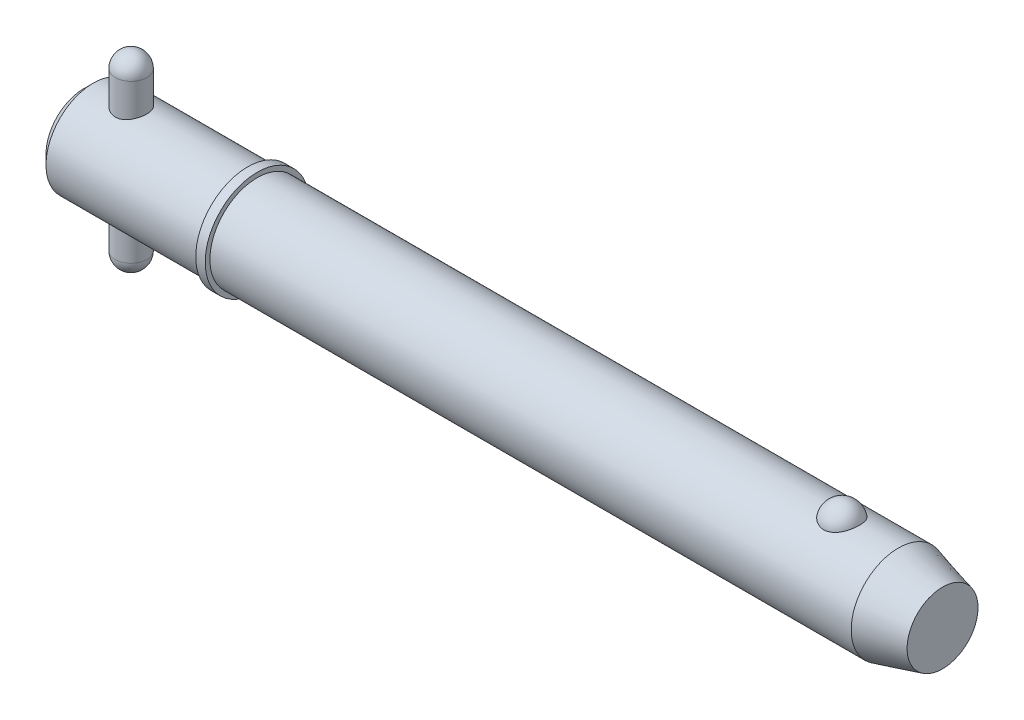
ISO-10303-21;
HEADER;
FILE_DESCRIPTION(('STEP AP214'),'2;1');
FILE_NAME('part.step','',(''),(''),'','','');
FILE_SCHEMA(('AUTOMOTIVE_DESIGN { 1 0 10303 214 1 1 1 1 }'));
ENDSEC;
DATA;
#1=APPLICATION_CONTEXT('core data for automotive mechanical design processes');
#2=APPLICATION_PROTOCOL_DEFINITION('international standard','automotive_design',2000,#1);
#3=PRODUCT_CONTEXT('',#1,'mechanical');
#4=PRODUCT('Part','Part','',(#3));
#5=PRODUCT_RELATED_PRODUCT_CATEGORY('part','',(#4));
#6=PRODUCT_DEFINITION_FORMATION('','',#4);
#7=PRODUCT_DEFINITION_CONTEXT('part definition',#1,'design');
#8=PRODUCT_DEFINITION('design','',#6,#7);
#9=PRODUCT_DEFINITION_SHAPE('','',#8);
#10=(LENGTH_UNIT() NAMED_UNIT(*) SI_UNIT(.MILLI.,.METRE.));
#11=(NAMED_UNIT(*) PLANE_ANGLE_UNIT() SI_UNIT($,.RADIAN.));
#12=(NAMED_UNIT(*) SI_UNIT($,.STERADIAN.) SOLID_ANGLE_UNIT());
#13=UNCERTAINTY_MEASURE_WITH_UNIT(LENGTH_MEASURE(1.E-05),#10,'distance_accuracy_value','');
#14=(GEOMETRIC_REPRESENTATION_CONTEXT(3) GLOBAL_UNCERTAINTY_ASSIGNED_CONTEXT((#13)) GLOBAL_UNIT_ASSIGNED_CONTEXT((#10,
#11,#12)) REPRESENTATION_CONTEXT('',''));
#15=CARTESIAN_POINT('',(0.,0.,0.));
#16=DIRECTION('',(0.,0.,1.));
#17=DIRECTION('',(1.,0.,0.));
#18=AXIS2_PLACEMENT_3D('',#15,#16,#17);
#19=CARTESIAN_POINT('',(9.525,19.05,0.));
#20=DIRECTION('',(0.,-1.,0.));
#21=DIRECTION('',(0.,0.,-1.));
#22=AXIS2_PLACEMENT_3D('',#19,#20,#21);
#23=CYLINDRICAL_SURFACE('',#22,3.175);
#24=CARTESIAN_POINT('',(9.525,-15.875,0.));
#25=DIRECTION('',(0.,-1.,0.));
#26=DIRECTION('',(0.,0.,-1.));
#27=AXIS2_PLACEMENT_3D('',#24,#25,#26);
#28=CIRCLE('',#27,3.175);
#29=CARTESIAN_POINT('',(9.525,-15.875,-3.175));
#30=VERTEX_POINT('',#29);
#31=EDGE_CURVE('P0_E10',#30,#30,#28,.F.);
#32=CARTESIAN_POINT('',(9.525,15.875,0.));
#33=DIRECTION('',(0.,-1.,0.));
#34=DIRECTION('',(0.,0.,-1.));
#35=AXIS2_PLACEMENT_3D('',#32,#33,#34);
#36=CIRCLE('',#35,3.175);
#37=CARTESIAN_POINT('',(9.525,15.875,-3.175));
#38=VERTEX_POINT('',#37);
#39=EDGE_CURVE('P0_E21',#38,#38,#36,.T.);
#40=CARTESIAN_POINT('',(9.525,-15.875,-3.175));
#41=CARTESIAN_POINT('',(9.525,-15.5442708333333,-3.175));
#42=CARTESIAN_POINT('',(9.525,-15.2135416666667,-3.175));
#43=CARTESIAN_POINT('',(9.525,-14.5520833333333,-3.175));
#44=CARTESIAN_POINT('',(9.525,-14.2213541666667,-3.175));
#45=CARTESIAN_POINT('',(9.525,-13.5598958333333,-3.175));
#46=CARTESIAN_POINT('',(9.525,-13.2291666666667,-3.175));
#47=CARTESIAN_POINT('',(9.525,-12.5677083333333,-3.175));
#48=CARTESIAN_POINT('',(9.525,-12.2369791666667,-3.175));
#49=CARTESIAN_POINT('',(9.525,-11.5755208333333,-3.175));
#50=CARTESIAN_POINT('',(9.525,-11.2447916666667,-3.175));
#51=CARTESIAN_POINT('',(9.525,-10.5833333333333,-3.175));
#52=CARTESIAN_POINT('',(9.525,-10.2526041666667,-3.175));
#53=CARTESIAN_POINT('',(9.525,-9.59114583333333,-3.175));
#54=CARTESIAN_POINT('',(9.525,-9.26041666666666,-3.175));
#55=CARTESIAN_POINT('',(9.525,-8.59895833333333,-3.175));
#56=CARTESIAN_POINT('',(9.525,-8.26822916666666,-3.175));
#57=CARTESIAN_POINT('',(9.525,-7.60677083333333,-3.175));
#58=CARTESIAN_POINT('',(9.525,-7.27604166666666,-3.175));
#59=CARTESIAN_POINT('',(9.525,-6.61458333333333,-3.175));
#60=CARTESIAN_POINT('',(9.525,-6.28385416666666,-3.175));
#61=CARTESIAN_POINT('',(9.525,-5.62239583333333,-3.175));
#62=CARTESIAN_POINT('',(9.525,-5.29166666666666,-3.175));
#63=CARTESIAN_POINT('',(9.525,-4.63020833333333,-3.175));
#64=CARTESIAN_POINT('',(9.525,-4.29947916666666,-3.175));
#65=CARTESIAN_POINT('',(9.525,-3.63802083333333,-3.175));
#66=CARTESIAN_POINT('',(9.525,-3.30729166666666,-3.175));
#67=CARTESIAN_POINT('',(9.525,-2.64583333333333,-3.175));
#68=CARTESIAN_POINT('',(9.525,-2.31510416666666,-3.175));
#69=CARTESIAN_POINT('',(9.525,-1.65364583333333,-3.175));
#70=CARTESIAN_POINT('',(9.525,-1.32291666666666,-3.175));
#71=CARTESIAN_POINT('',(9.525,-0.661458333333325,-3.175));
#72=CARTESIAN_POINT('',(9.525,-0.330729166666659,-3.175));
#73=CARTESIAN_POINT('',(9.525,0.330729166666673,-3.175));
#74=CARTESIAN_POINT('',(9.525,0.661458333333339,-3.175));
#75=CARTESIAN_POINT('',(9.525,1.32291666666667,-3.175));
#76=CARTESIAN_POINT('',(9.525,1.65364583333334,-3.175));
#77=CARTESIAN_POINT('',(9.525,2.31510416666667,-3.175));
#78=CARTESIAN_POINT('',(9.525,2.64583333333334,-3.175));
#79=CARTESIAN_POINT('',(9.525,3.30729166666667,-3.175));
#80=CARTESIAN_POINT('',(9.525,3.63802083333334,-3.175));
#81=CARTESIAN_POINT('',(9.525,4.29947916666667,-3.175));
#82=CARTESIAN_POINT('',(9.525,4.63020833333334,-3.175));
#83=CARTESIAN_POINT('',(9.525,5.29166666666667,-3.175));
#84=CARTESIAN_POINT('',(9.525,5.62239583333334,-3.175));
#85=CARTESIAN_POINT('',(9.525,6.28385416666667,-3.175));
#86=CARTESIAN_POINT('',(9.525,6.61458333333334,-3.175));
#87=CARTESIAN_POINT('',(9.525,7.27604166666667,-3.175));
#88=CARTESIAN_POINT('',(9.525,7.60677083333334,-3.175));
#89=CARTESIAN_POINT('',(9.525,8.26822916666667,-3.175));
#90=CARTESIAN_POINT('',(9.525,8.59895833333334,-3.175));
#91=CARTESIAN_POINT('',(9.525,9.26041666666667,-3.175));
#92=CARTESIAN_POINT('',(9.525,9.59114583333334,-3.175));
#93=CARTESIAN_POINT('',(9.525,10.2526041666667,-3.175));
#94=CARTESIAN_POINT('',(9.525,10.5833333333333,-3.175));
#95=CARTESIAN_POINT('',(9.525,11.2447916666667,-3.175));
#96=CARTESIAN_POINT('',(9.525,11.5755208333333,-3.175));
#97=CARTESIAN_POINT('',(9.525,12.2369791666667,-3.175));
#98=CARTESIAN_POINT('',(9.525,12.5677083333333,-3.175));
#99=CARTESIAN_POINT('',(9.525,13.2291666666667,-3.175));
#100=CARTESIAN_POINT('',(9.525,13.5598958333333,-3.175));
#101=CARTESIAN_POINT('',(9.525,14.2213541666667,-3.175));
#102=CARTESIAN_POINT('',(9.525,14.5520833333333,-3.175));
#103=CARTESIAN_POINT('',(9.525,15.2135416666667,-3.175));
#104=CARTESIAN_POINT('',(9.525,15.5442708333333,-3.175));
#105=CARTESIAN_POINT('',(9.525,15.875,-3.175));
#106=B_SPLINE_CURVE_WITH_KNOTS('',3,(#40,#41,#42,#43,#44,#45,#46,#47,#48,#49,#50,#51,#52,#53,
#54,#55,#56,#57,#58,#59,#60,#61,#62,#63,#64,#65,#66,#67,#68,#69,#70,#71,#72,#73,#74,#75,#76,#77,
#78,#79,#80,#81,#82,#83,#84,#85,#86,#87,#88,#89,#90,#91,#92,#93,#94,#95,#96,#97,#98,#99,#100,
#101,#102,#103,#104,#105),.UNSPECIFIED.,.F.,.F.,(4,2,2,2,2,2,2,2,2,2,2,2,2,2,2,2,2,2,2,2,2,2,2,
2,2,2,2,2,2,2,2,2,4),(0.,0.992187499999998,1.984375,2.9765625,3.96875,4.96093749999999,5.953125,
6.9453125,7.9375,8.92968749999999,9.921875,10.9140625,11.90625,12.8984375,13.890625,14.8828125,
15.875,16.8671875,17.859375,18.8515625,19.84375,20.8359375,21.828125,22.8203125,23.8125,
24.8046875,25.796875,26.7890625,27.78125,28.7734375,29.765625,30.7578125,31.75),.UNSPECIFIED.);
#107=EDGE_CURVE('P0_BSEAM14',#30,#38,#106,.T.);
#108=ORIENTED_EDGE('',*,*,#31,.T.);
#109=ORIENTED_EDGE('',*,*,#39,.T.);
#110=ORIENTED_EDGE('',*,*,#107,.T.);
#111=ORIENTED_EDGE('',*,*,#107,.F.);
#112=EDGE_LOOP('',(#108,#110,#109,#111));
#113=FACE_BOUND('',#112,.T.);
#114=ADVANCED_FACE('P0_F14',(#113),#23,.T.);
#115=CARTESIAN_POINT('',(9.525,-15.875,0.));
#116=DIRECTION('',(0.,0.,1.));
#117=DIRECTION('',(1.,0.,0.));
#118=AXIS2_PLACEMENT_3D('',#115,#116,#117);
#119=SPHERICAL_SURFACE('',#118,3.175);
#120=CARTESIAN_POINT('',(9.525,-15.875,0.));
#121=DIRECTION('',(0.,-1.,0.));
#122=DIRECTION('',(0.,0.,-1.));
#123=AXIS2_PLACEMENT_3D('',#120,#121,#122);
#124=SPHERICAL_SURFACE('',#123,3.175);
#125=ORIENTED_EDGE('',*,*,#31,.F.);
#126=EDGE_LOOP('',(#125));
#127=FACE_BOUND('',#126,.T.);
#128=ADVANCED_FACE('P0_F29',(#127),#124,.T.);
#129=CARTESIAN_POINT('',(9.525,15.875,0.));
#130=DIRECTION('',(0.,0.,1.));
#131=DIRECTION('',(1.,0.,0.));
#132=AXIS2_PLACEMENT_3D('',#129,#130,#131);
#133=SPHERICAL_SURFACE('',#132,3.175);
#134=CARTESIAN_POINT('',(9.525,15.875,0.));
#135=DIRECTION('',(0.,-1.,0.));
#136=DIRECTION('',(0.,0.,-1.));
#137=AXIS2_PLACEMENT_3D('',#134,#135,#136);
#138=SPHERICAL_SURFACE('',#137,3.175);
#139=ORIENTED_EDGE('',*,*,#39,.F.);
#140=EDGE_LOOP('',(#139));
#141=FACE_BOUND('',#140,.T.);
#142=ADVANCED_FACE('P0_F16',(#141),#138,.T.);
#143=CLOSED_SHELL('',(#114,#128,#142));
#144=MANIFOLD_SOLID_BREP('P0_B1',#143);
#145=CARTESIAN_POINT('',(0.,0.,0.));
#146=DIRECTION('',(1.,0.,0.));
#147=DIRECTION('',(0.,0.,-1.));
#148=AXIS2_PLACEMENT_3D('',#145,#146,#147);
#149=CYLINDRICAL_SURFACE('',#148,9.525);
#150=CARTESIAN_POINT('',(164.143054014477,0.,0.));
#151=DIRECTION('',(1.,0.,0.));
#152=DIRECTION('',(0.,0.,-1.));
#153=AXIS2_PLACEMENT_3D('',#150,#151,#152);
#154=CIRCLE('',#153,9.525);
#155=CARTESIAN_POINT('',(164.143054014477,0.,-9.525));
#156=VERTEX_POINT('',#155);
#157=EDGE_CURVE('P1_E81',#156,#156,#154,.T.);
#158=ORIENTED_EDGE('',*,*,#157,.F.);
#159=EDGE_LOOP('',(#158));
#160=FACE_BOUND('',#159,.T.);
#161=CARTESIAN_POINT('',(34.93,0.,0.));
#162=DIRECTION('',(1.,0.,0.));
#163=DIRECTION('',(0.,0.,-1.));
#164=AXIS2_PLACEMENT_3D('',#161,#162,#163);
#165=CIRCLE('',#164,9.525);
#166=CARTESIAN_POINT('',(34.93,0.,-9.525));
#167=VERTEX_POINT('',#166);
#168=EDGE_CURVE('P1_E85',#167,#167,#165,.T.);
#169=ORIENTED_EDGE('',*,*,#168,.T.);
#170=EDGE_LOOP('',(#169));
#171=FACE_BOUND('',#170,.T.);
#172=CARTESIAN_POINT('',(152.745757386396,8.80405803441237,3.63513233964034));
#173=CARTESIAN_POINT('',(152.651676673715,8.80405953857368,3.63513053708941));
#174=CARTESIAN_POINT('',(152.557561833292,8.80561325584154,3.63137461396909));
#175=CARTESIAN_POINT('',(152.370012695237,8.81177748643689,3.61638665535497));
#176=CARTESIAN_POINT('',(152.276578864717,8.81638992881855,3.60514990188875));
#177=CARTESIAN_POINT('',(151.997945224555,8.83467114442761,3.56024627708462));
#178=CARTESIAN_POINT('',(151.814691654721,8.85278327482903,3.51538626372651));
#179=CARTESIAN_POINT('',(151.459509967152,8.89871214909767,3.39742145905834));
#180=CARTESIAN_POINT('',(151.287553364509,8.92650327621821,3.32439116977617));
#181=CARTESIAN_POINT('',(150.958707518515,8.98874819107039,3.15220244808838));
#182=CARTESIAN_POINT('',(150.801811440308,9.02319893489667,3.05305594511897));
#183=CARTESIAN_POINT('',(150.502214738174,9.09629186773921,2.82797815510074));
#184=CARTESIAN_POINT('',(150.360060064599,9.13502685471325,2.70135138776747));
#185=CARTESIAN_POINT('',(150.098299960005,9.21186572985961,2.42641932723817));
#186=CARTESIAN_POINT('',(149.978701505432,9.24996941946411,2.2781073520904));
#187=CARTESIAN_POINT('',(149.759645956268,9.32341082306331,1.95652290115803));
#188=CARTESIAN_POINT('',(149.661317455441,9.35855090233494,1.78243511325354));
#189=CARTESIAN_POINT('',(149.493819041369,9.42045142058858,1.41937246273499));
#190=CARTESIAN_POINT('',(149.424651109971,9.44721128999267,1.23039658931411));
#191=CARTESIAN_POINT('',(149.316199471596,9.48990641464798,0.840370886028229));
#192=CARTESIAN_POINT('',(149.277288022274,9.50570658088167,0.639202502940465));
#193=CARTESIAN_POINT('',(149.231555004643,9.52433146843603,0.232664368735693));
#194=CARTESIAN_POINT('',(149.224732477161,9.52715657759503,0.0272947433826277));
#195=CARTESIAN_POINT('',(149.243255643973,9.51956918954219,-0.380478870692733));
#196=CARTESIAN_POINT('',(149.268405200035,9.50923740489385,-0.582893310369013));
#197=CARTESIAN_POINT('',(149.35002537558,9.47651897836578,-0.98029399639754));
#198=CARTESIAN_POINT('',(149.406496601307,9.45413210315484,-1.17528009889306));
#199=CARTESIAN_POINT('',(149.549719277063,9.39954044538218,-1.55263697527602));
#200=CARTESIAN_POINT('',(149.636512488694,9.36732213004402,-1.73498993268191));
#201=CARTESIAN_POINT('',(149.838610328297,9.29640700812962,-2.08177763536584));
#202=CARTESIAN_POINT('',(149.953917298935,9.25770966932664,-2.24621090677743));
#203=CARTESIAN_POINT('',(150.211264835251,9.17775604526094,-2.5533833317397));
#204=CARTESIAN_POINT('',(150.353434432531,9.136488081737,-2.696011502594));
#205=CARTESIAN_POINT('',(150.66089985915,9.05620497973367,-2.95451229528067));
#206=CARTESIAN_POINT('',(150.826193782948,9.01718965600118,-3.07038711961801));
#207=CARTESIAN_POINT('',(151.172052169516,8.94680019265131,-3.26976836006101));
#208=CARTESIAN_POINT('',(151.352227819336,8.91528408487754,-3.35389750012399));
#209=CARTESIAN_POINT('',(151.725651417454,8.86272514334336,-3.49043503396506));
#210=CARTESIAN_POINT('',(151.918894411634,8.84167836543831,-3.54285537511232));
#211=CARTESIAN_POINT('',(152.302503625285,8.81348056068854,-3.61241306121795));
#212=CARTESIAN_POINT('',(152.492525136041,8.80568348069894,-3.6311933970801));
#213=CARTESIAN_POINT('',(152.873190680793,8.80289410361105,-3.63795342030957));
#214=CARTESIAN_POINT('',(153.063834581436,8.80789922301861,-3.62593932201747));
#215=CARTESIAN_POINT('',(153.434007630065,8.82974915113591,-3.57238430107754));
#216=CARTESIAN_POINT('',(153.613697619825,8.84621463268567,-3.53178890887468));
#217=CARTESIAN_POINT('',(153.963422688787,8.88875330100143,-3.42331083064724));
#218=CARTESIAN_POINT('',(154.133456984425,8.91482726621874,-3.35542593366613));
#219=CARTESIAN_POINT('',(154.463237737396,8.97448239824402,-3.19248225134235));
#220=CARTESIAN_POINT('',(154.622680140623,9.00821446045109,-3.0968647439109));
#221=CARTESIAN_POINT('',(154.923513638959,9.07935398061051,-2.88162736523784));
#222=CARTESIAN_POINT('',(155.064900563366,9.11676228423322,-2.76200196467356));
#223=CARTESIAN_POINT('',(155.33331931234,9.19347419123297,-2.49516285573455));
#224=CARTESIAN_POINT('',(155.459275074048,9.23277872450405,-2.34686614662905));
#225=CARTESIAN_POINT('',(155.685522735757,9.3073761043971,-2.03093683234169));
#226=CARTESIAN_POINT('',(155.78581004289,9.34266823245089,-1.86330077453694));
#227=CARTESIAN_POINT('',(155.961514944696,9.40674710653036,-1.50744893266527));
#228=CARTESIAN_POINT('',(156.036041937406,9.43529176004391,-1.31874876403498));
#229=CARTESIAN_POINT('',(156.15416505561,9.48144132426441,-0.930631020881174));
#230=CARTESIAN_POINT('',(156.197760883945,9.49904612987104,-0.731213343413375));
#231=CARTESIAN_POINT('',(156.253158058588,9.5215314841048,-0.327147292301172));
#232=CARTESIAN_POINT('',(156.264935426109,9.52640243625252,-0.122495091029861));
#233=CARTESIAN_POINT('',(156.256382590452,9.5228957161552,0.28601848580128));
#234=CARTESIAN_POINT('',(156.23605305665,9.5145183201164,0.489879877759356));
#235=CARTESIAN_POINT('',(156.163884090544,9.48544083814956,0.88999431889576));
#236=CARTESIAN_POINT('',(156.112199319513,9.46480124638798,1.08627971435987));
#237=CARTESIAN_POINT('',(155.978491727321,9.4133389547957,1.46682086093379));
#238=CARTESIAN_POINT('',(155.896466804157,9.38251554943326,1.65107577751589));
#239=CARTESIAN_POINT('',(155.70319292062,9.31365636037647,2.00346348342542));
#240=CARTESIAN_POINT('',(155.591783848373,9.27558138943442,2.17150083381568));
#241=CARTESIAN_POINT('',(155.342294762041,9.19638714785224,2.48563115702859));
#242=CARTESIAN_POINT('',(155.204216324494,9.15526805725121,2.63172542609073));
#243=CARTESIAN_POINT('',(154.904843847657,9.07465393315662,2.89750997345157));
#244=CARTESIAN_POINT('',(154.743610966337,9.03515496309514,3.01726776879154));
#245=CARTESIAN_POINT('',(154.401613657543,8.96227564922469,3.22732920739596));
#246=CARTESIAN_POINT('',(154.220841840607,8.92889763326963,3.31762165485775));
#247=CARTESIAN_POINT('',(153.851445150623,8.8734538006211,3.46314419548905));
#248=CARTESIAN_POINT('',(153.66332371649,8.85102983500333,3.51950082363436));
#249=CARTESIAN_POINT('',(153.37578699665,8.82666967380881,3.57993683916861));
#250=CARTESIAN_POINT('',(153.279133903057,8.82009725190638,3.59606217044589));
#251=CARTESIAN_POINT('',(153.084677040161,8.81020897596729,3.62022512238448));
#252=CARTESIAN_POINT('',(152.986874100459,8.80689090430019,3.62826825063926));
#253=CARTESIAN_POINT('',(152.841224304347,8.80445615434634,3.63416760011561));
#254=CARTESIAN_POINT('',(152.793495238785,8.80405727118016,3.63513325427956));
#255=CARTESIAN_POINT('',(152.745757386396,8.80405803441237,3.63513233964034));
#256=B_SPLINE_CURVE_WITH_KNOTS('',3,(#172,#173,#174,#175,#176,#177,#178,#179,#180,#181,#182,
#183,#184,#185,#186,#187,#188,#189,#190,#191,#192,#193,#194,#195,#196,#197,#198,#199,#200,#201,
#202,#203,#204,#205,#206,#207,#208,#209,#210,#211,#212,#213,#214,#215,#216,#217,#218,#219,#220,
#221,#222,#223,#224,#225,#226,#227,#228,#229,#230,#231,#232,#233,#234,#235,#236,#237,#238,#239,
#240,#241,#242,#243,#244,#245,#246,#247,#248,#249,#250,#251,#252,#253,#254,#255),.UNSPECIFIED.,
.T.,.F.,(4,2,2,2,2,2,2,2,2,2,2,2,2,2,2,2,2,2,2,2,2,2,2,2,2,2,2,2,2,2,2,2,2,2,2,2,2,2,2,2,2,4),
(0.,0.282202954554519,0.564584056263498,1.13017050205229,1.69427128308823,2.25811483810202,
2.83836627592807,3.41879688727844,4.02497117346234,4.63118665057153,5.24474754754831,
5.85829010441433,6.46808687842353,7.07789545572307,7.68854723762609,8.299249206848,
8.91296283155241,9.52662591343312,10.1275338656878,10.7282152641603,11.2986646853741,
11.8689989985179,12.4213015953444,12.973648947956,13.5380053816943,14.1024919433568,
14.695298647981,15.2882113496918,15.8999469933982,16.5116885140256,17.1238909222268,
17.7360805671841,18.3452748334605,18.9545113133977,19.567138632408,20.179729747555,
20.7907316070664,21.4019653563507,21.9915938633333,22.2859053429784,22.5800161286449,
22.7232098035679),.UNSPECIFIED.);
#257=CARTESIAN_POINT('',(152.745757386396,8.80405803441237,3.63513233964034));
#258=VERTEX_POINT('',#257);
#259=EDGE_CURVE('P1_E35',#258,#258,#256,.T.);
#260=ORIENTED_EDGE('',*,*,#259,.T.);
#261=EDGE_LOOP('',(#260));
#262=FACE_BOUND('',#261,.T.);
#263=ADVANCED_FACE('P1_F13',(#160,#171,#262),#149,.T.);
#264=CARTESIAN_POINT('',(0.,0.,0.));
#265=DIRECTION('',(-1.,0.,0.));
#266=DIRECTION('',(0.,0.,1.));
#267=AXIS2_PLACEMENT_3D('',#264,#265,#266);
#268=PLANE('',#267);
#269=CARTESIAN_POINT('',(0.,0.,0.));
#270=DIRECTION('',(1.,0.,0.));
#271=DIRECTION('',(0.,0.,-1.));
#272=AXIS2_PLACEMENT_3D('',#269,#270,#271);
#273=CIRCLE('',#272,7.62);
#274=CARTESIAN_POINT('',(0.,0.,-7.62));
#275=VERTEX_POINT('',#274);
#276=EDGE_CURVE('P1_E9',#275,#275,#273,.T.);
#277=ORIENTED_EDGE('',*,*,#276,.F.);
#278=EDGE_LOOP('',(#277));
#279=FACE_BOUND('',#278,.T.);
#280=ADVANCED_FACE('P1_F15',(#279),#268,.T.);
#281=CARTESIAN_POINT('',(1.90499999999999,0.,0.));
#282=DIRECTION('',(1.,0.,0.));
#283=DIRECTION('',(0.,0.,-1.));
#284=AXIS2_PLACEMENT_3D('',#281,#282,#283);
#285=CONICAL_SURFACE('',#284,9.525,0.785398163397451);
#286=ORIENTED_EDGE('',*,*,#276,.T.);
#287=EDGE_LOOP('',(#286));
#288=FACE_BOUND('',#287,.T.);
#289=CARTESIAN_POINT('',(1.90499999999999,0.,0.));
#290=DIRECTION('',(1.,0.,0.));
#291=DIRECTION('',(0.,0.,-1.));
#292=AXIS2_PLACEMENT_3D('',#289,#290,#291);
#293=CIRCLE('',#292,9.525);
#294=CARTESIAN_POINT('',(1.90499999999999,0.,-9.525));
#295=VERTEX_POINT('',#294);
#296=EDGE_CURVE('P1_E26',#295,#295,#293,.T.);
#297=ORIENTED_EDGE('',*,*,#296,.F.);
#298=EDGE_LOOP('',(#297));
#299=FACE_BOUND('',#298,.T.);
#300=ADVANCED_FACE('P1_F77',(#288,#299),#285,.T.);
#301=CARTESIAN_POINT('',(0.,0.,0.));
#302=DIRECTION('',(1.,0.,0.));
#303=DIRECTION('',(0.,0.,-1.));
#304=AXIS2_PLACEMENT_3D('',#301,#302,#303);
#305=CYLINDRICAL_SURFACE('',#304,9.525);
#306=CARTESIAN_POINT('',(9.525,-8.98025612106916,3.175));
#307=CARTESIAN_POINT('',(9.35206354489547,-8.98025555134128,3.17500081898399));
#308=CARTESIAN_POINT('',(9.17913201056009,-8.98530617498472,3.16082293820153));
#309=CARTESIAN_POINT('',(8.83839221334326,-9.00485797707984,3.10467734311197));
#310=CARTESIAN_POINT('',(8.67058479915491,-9.0193607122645,3.06270505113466));
#311=CARTESIAN_POINT('',(8.34508461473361,-9.05599546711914,2.95260866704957));
#312=CARTESIAN_POINT('',(8.18737272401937,-9.07811252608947,2.88453582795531));
#313=CARTESIAN_POINT('',(7.88555684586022,-9.12746212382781,2.72434567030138));
#314=CARTESIAN_POINT('',(7.74145587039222,-9.1546957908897,2.63222304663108));
#315=CARTESIAN_POINT('',(7.46531411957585,-9.21240503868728,2.42268738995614));
#316=CARTESIAN_POINT('',(7.33388351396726,-9.24296141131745,2.30449228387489));
#317=CARTESIAN_POINT('',(7.09229340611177,-9.30319020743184,2.0478358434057));
#318=CARTESIAN_POINT('',(6.98213731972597,-9.33286248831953,1.90937126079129));
#319=CARTESIAN_POINT('',(6.78345450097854,-9.38891527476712,1.61164431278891));
#320=CARTESIAN_POINT('',(6.69556709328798,-9.41518969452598,1.45193356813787));
#321=CARTESIAN_POINT('',(6.54814671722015,-9.46053437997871,1.11896913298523));
#322=CARTESIAN_POINT('',(6.48860610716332,-9.47960658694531,0.945719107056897));
#323=CARTESIAN_POINT('',(6.40163866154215,-9.50782564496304,0.596991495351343));
#324=CARTESIAN_POINT('',(6.373166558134,-9.5172947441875,0.421801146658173));
#325=CARTESIAN_POINT('',(6.3458207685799,-9.52638456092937,0.068890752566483));
#326=CARTESIAN_POINT('',(6.34693945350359,-9.52600781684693,-0.108828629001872));
#327=CARTESIAN_POINT('',(6.37808050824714,-9.51566675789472,-0.454353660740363));
#328=CARTESIAN_POINT('',(6.4069675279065,-9.50607905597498,-0.622274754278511));
#329=CARTESIAN_POINT('',(6.490947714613,-9.47886621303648,-0.950732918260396));
#330=CARTESIAN_POINT('',(6.54604265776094,-9.46124052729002,-1.11126948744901));
#331=CARTESIAN_POINT('',(6.68153768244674,-9.41945253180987,-1.42288410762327));
#332=CARTESIAN_POINT('',(6.76226085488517,-9.3952073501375,-1.57381010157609));
#333=CARTESIAN_POINT('',(6.94645456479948,-9.34270397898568,-1.86030973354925));
#334=CARTESIAN_POINT('',(7.04993142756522,-9.31444467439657,-1.99587908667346));
#335=CARTESIAN_POINT('',(7.28241619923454,-9.25532159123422,-2.2545702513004));
#336=CARTESIAN_POINT('',(7.4123967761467,-9.22439783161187,-2.37680549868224));
#337=CARTESIAN_POINT('',(7.69127470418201,-9.1645528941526,-2.5980302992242));
#338=CARTESIAN_POINT('',(7.84017496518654,-9.13563202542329,-2.6970162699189));
#339=CARTESIAN_POINT('',(8.15547526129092,-9.08273917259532,-2.87016016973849));
#340=CARTESIAN_POINT('',(8.32209451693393,-9.05884361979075,-2.94394402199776));
#341=CARTESIAN_POINT('',(8.66638917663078,-9.01959241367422,-3.06210713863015));
#342=CARTESIAN_POINT('',(8.84405991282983,-9.00423318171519,-3.10649872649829));
#343=CARTESIAN_POINT('',(9.19682677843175,-8.98460345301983,-3.16281207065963));
#344=CARTESIAN_POINT('',(9.37167742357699,-8.9798639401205,-3.17610837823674));
#345=CARTESIAN_POINT('',(9.72113927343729,-8.9806993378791,-3.17374726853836));
#346=CARTESIAN_POINT('',(9.89575051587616,-8.98627237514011,-3.15809511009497));
#347=CARTESIAN_POINT('',(10.2335233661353,-9.00663737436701,-3.09951644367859));
#348=CARTESIAN_POINT('',(10.3968722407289,-9.02110608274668,-3.05754530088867));
#349=CARTESIAN_POINT('',(10.7141759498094,-9.05727657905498,-2.94866651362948));
#350=CARTESIAN_POINT('',(10.8681291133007,-9.07897964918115,-2.88175444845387));
#351=CARTESIAN_POINT('',(11.1676828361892,-9.12802586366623,-2.72248103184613));
#352=CARTESIAN_POINT('',(11.3128635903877,-9.1555260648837,-2.62937980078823));
#353=CARTESIAN_POINT('',(11.5860387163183,-9.21276315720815,-2.42120937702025));
#354=CARTESIAN_POINT('',(11.7140280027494,-9.24250070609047,-2.30613370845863));
#355=CARTESIAN_POINT('',(11.9555513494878,-9.30259247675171,-2.05070616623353));
#356=CARTESIAN_POINT('',(12.0680936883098,-9.33290753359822,-1.90940458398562));
#357=CARTESIAN_POINT('',(12.267933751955,-9.3893275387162,-1.60917665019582));
#358=CARTESIAN_POINT('',(12.3552323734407,-9.41543263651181,-1.45025092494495));
#359=CARTESIAN_POINT('',(12.5013088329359,-9.46036988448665,-1.12007606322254));
#360=CARTESIAN_POINT('',(12.5602723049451,-9.47924920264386,-0.9489158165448));
#361=CARTESIAN_POINT('',(12.6483355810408,-9.50781089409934,-0.598355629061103));
#362=CARTESIAN_POINT('',(12.6774461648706,-9.5174965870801,-0.4189586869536));
#363=CARTESIAN_POINT('',(12.7040070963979,-9.52632915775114,-0.066088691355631));
#364=CARTESIAN_POINT('',(12.7028811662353,-9.52594996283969,0.107266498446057));
#365=CARTESIAN_POINT('',(12.6725130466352,-9.51586223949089,0.451202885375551));
#366=CARTESIAN_POINT('',(12.643273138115,-9.50615446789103,0.621784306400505));
#367=CARTESIAN_POINT('',(12.5584514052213,-9.47867404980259,0.952633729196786));
#368=CARTESIAN_POINT('',(12.5032953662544,-9.46103195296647,1.1130225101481));
#369=CARTESIAN_POINT('',(12.3686013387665,-9.41949985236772,1.42233126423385));
#370=CARTESIAN_POINT('',(12.2890589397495,-9.39560871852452,1.57124915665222));
#371=CARTESIAN_POINT('',(12.1044667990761,-9.34294133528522,1.85938800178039));
#372=CARTESIAN_POINT('',(11.9985831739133,-9.31401720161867,1.9980473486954));
#373=CARTESIAN_POINT('',(11.7657327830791,-9.25490239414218,2.25609475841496));
#374=CARTESIAN_POINT('',(11.6387592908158,-9.22471131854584,2.37547664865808));
#375=CARTESIAN_POINT('',(11.3613902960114,-9.16505913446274,2.59633024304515));
#376=CARTESIAN_POINT('',(11.2102725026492,-9.13567286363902,2.69691791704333));
#377=CARTESIAN_POINT('',(10.8923631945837,-9.08241113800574,2.87119803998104));
#378=CARTESIAN_POINT('',(10.7255757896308,-9.05853424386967,2.94489751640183));
#379=CARTESIAN_POINT('',(10.3887212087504,-9.02021736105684,3.06020415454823));
#380=CARTESIAN_POINT('',(10.219143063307,-9.00539959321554,3.10311136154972));
#381=CARTESIAN_POINT('',(9.87470703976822,-8.98542092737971,3.16050396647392));
#382=CARTESIAN_POINT('',(9.699851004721,-8.98025669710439,3.17499917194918));
#383=CARTESIAN_POINT('',(9.525,-8.98025612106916,3.175));
#384=B_SPLINE_CURVE_WITH_KNOTS('',3,(#306,#307,#308,#309,#310,#311,#312,#313,#314,#315,#316,
#317,#318,#319,#320,#321,#322,#323,#324,#325,#326,#327,#328,#329,#330,#331,#332,#333,#334,#335,
#336,#337,#338,#339,#340,#341,#342,#343,#344,#345,#346,#347,#348,#349,#350,#351,#352,#353,#354,
#355,#356,#357,#358,#359,#360,#361,#362,#363,#364,#365,#366,#367,#368,#369,#370,#371,#372,#373,
#374,#375,#376,#377,#378,#379,#380,#381,#382,#383),.UNSPECIFIED.,.T.,.F.,(4,2,2,2,2,2,2,2,2,2,2,
2,2,2,2,2,2,2,2,2,2,2,2,2,2,2,2,2,2,2,2,2,2,2,2,2,2,2,4),(0.,0.518161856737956,1.03640907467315,
1.55364379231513,2.07099270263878,2.60671746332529,3.14252816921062,3.69231882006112,
4.24196117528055,4.77247962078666,5.30286129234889,5.81244090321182,6.32205505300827,
6.83836754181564,7.3548237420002,7.89559553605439,8.43645060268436,8.98501631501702,
9.53335188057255,10.056948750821,10.5804505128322,11.0859695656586,11.5915782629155,
12.1132237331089,12.6350231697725,13.1819271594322,13.7288117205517,14.2720628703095,
14.815117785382,15.3326491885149,15.8501386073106,16.3594083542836,16.868770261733,
17.3969527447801,17.925304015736,18.4743376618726,19.023227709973,19.5473069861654,
20.0712053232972),.UNSPECIFIED.);
#385=CARTESIAN_POINT('',(9.525,-8.98025612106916,3.175));
#386=VERTEX_POINT('',#385);
#387=EDGE_CURVE('P1_E17',#386,#386,#384,.T.);
#388=ORIENTED_EDGE('',*,*,#387,.F.);
#389=EDGE_LOOP('',(#388));
#390=FACE_BOUND('',#389,.T.);
#391=CARTESIAN_POINT('',(9.525,8.98025612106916,3.175));
#392=CARTESIAN_POINT('',(9.69793645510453,8.98025555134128,3.17500081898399));
#393=CARTESIAN_POINT('',(9.87086798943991,8.98530617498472,3.16082293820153));
#394=CARTESIAN_POINT('',(10.2116077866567,9.00485797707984,3.10467734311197));
#395=CARTESIAN_POINT('',(10.3794152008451,9.0193607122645,3.06270505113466));
#396=CARTESIAN_POINT('',(10.7049153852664,9.05599546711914,2.95260866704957));
#397=CARTESIAN_POINT('',(10.8626272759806,9.07811252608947,2.88453582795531));
#398=CARTESIAN_POINT('',(11.1644431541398,9.12746212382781,2.72434567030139));
#399=CARTESIAN_POINT('',(11.3085441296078,9.15469579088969,2.63222304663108));
#400=CARTESIAN_POINT('',(11.5846858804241,9.21240503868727,2.42268738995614));
#401=CARTESIAN_POINT('',(11.7161164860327,9.24296141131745,2.30449228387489));
#402=CARTESIAN_POINT('',(11.9577065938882,9.30319020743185,2.0478358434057));
#403=CARTESIAN_POINT('',(12.067862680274,9.33286248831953,1.90937126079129));
#404=CARTESIAN_POINT('',(12.2665454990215,9.38891527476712,1.61164431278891));
#405=CARTESIAN_POINT('',(12.354432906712,9.41518969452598,1.45193356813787));
#406=CARTESIAN_POINT('',(12.5018532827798,9.46053437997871,1.11896913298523));
#407=CARTESIAN_POINT('',(12.5613938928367,9.47960658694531,0.945719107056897));
#408=CARTESIAN_POINT('',(12.6483613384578,9.50782564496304,0.596991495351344));
#409=CARTESIAN_POINT('',(12.676833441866,9.5172947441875,0.421801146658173));
#410=CARTESIAN_POINT('',(12.7041792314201,9.52638456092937,0.0688907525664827));
#411=CARTESIAN_POINT('',(12.7030605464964,9.52600781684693,-0.108828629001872));
#412=CARTESIAN_POINT('',(12.6719194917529,9.51566675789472,-0.454353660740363));
#413=CARTESIAN_POINT('',(12.6430324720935,9.50607905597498,-0.622274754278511));
#414=CARTESIAN_POINT('',(12.559052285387,9.47886621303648,-0.950732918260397));
#415=CARTESIAN_POINT('',(12.5039573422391,9.46124052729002,-1.11126948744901));
#416=CARTESIAN_POINT('',(12.3684623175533,9.41945253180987,-1.42288410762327));
#417=CARTESIAN_POINT('',(12.2877391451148,9.3952073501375,-1.57381010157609));
#418=CARTESIAN_POINT('',(12.1035454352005,9.34270397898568,-1.86030973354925));
#419=CARTESIAN_POINT('',(12.0000685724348,9.31444467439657,-1.99587908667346));
#420=CARTESIAN_POINT('',(11.7675838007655,9.25532159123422,-2.2545702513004));
#421=CARTESIAN_POINT('',(11.6376032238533,9.22439783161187,-2.37680549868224));
#422=CARTESIAN_POINT('',(11.358725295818,9.1645528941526,-2.5980302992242));
#423=CARTESIAN_POINT('',(11.2098250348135,9.13563202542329,-2.6970162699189));
#424=CARTESIAN_POINT('',(10.8945247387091,9.08273917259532,-2.87016016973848));
#425=CARTESIAN_POINT('',(10.7279054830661,9.05884361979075,-2.94394402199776));
#426=CARTESIAN_POINT('',(10.3836108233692,9.01959241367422,-3.06210713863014));
#427=CARTESIAN_POINT('',(10.2059400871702,9.00423318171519,-3.10649872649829));
#428=CARTESIAN_POINT('',(9.85317322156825,8.98460345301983,-3.16281207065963));
#429=CARTESIAN_POINT('',(9.67832257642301,8.9798639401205,-3.17610837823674));
#430=CARTESIAN_POINT('',(9.32886072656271,8.9806993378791,-3.17374726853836));
#431=CARTESIAN_POINT('',(9.15424948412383,8.98627237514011,-3.15809511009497));
#432=CARTESIAN_POINT('',(8.81647663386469,9.00663737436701,-3.09951644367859));
#433=CARTESIAN_POINT('',(8.65312775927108,9.02110608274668,-3.05754530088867));
#434=CARTESIAN_POINT('',(8.33582405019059,9.05727657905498,-2.94866651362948));
#435=CARTESIAN_POINT('',(8.18187088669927,9.07897964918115,-2.88175444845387));
#436=CARTESIAN_POINT('',(7.88231716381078,9.12802586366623,-2.72248103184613));
#437=CARTESIAN_POINT('',(7.73713640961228,9.1555260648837,-2.62937980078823));
#438=CARTESIAN_POINT('',(7.46396128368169,9.21276315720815,-2.42120937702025));
#439=CARTESIAN_POINT('',(7.33597199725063,9.24250070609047,-2.30613370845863));
#440=CARTESIAN_POINT('',(7.09444865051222,9.30259247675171,-2.05070616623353));
#441=CARTESIAN_POINT('',(6.98190631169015,9.33290753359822,-1.90940458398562));
#442=CARTESIAN_POINT('',(6.78206624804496,9.3893275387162,-1.60917665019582));
#443=CARTESIAN_POINT('',(6.6947676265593,9.41543263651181,-1.45025092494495));
#444=CARTESIAN_POINT('',(6.54869116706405,9.46036988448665,-1.12007606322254));
#445=CARTESIAN_POINT('',(6.48972769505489,9.47924920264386,-0.948915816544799));
#446=CARTESIAN_POINT('',(6.40166441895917,9.50781089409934,-0.598355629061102));
#447=CARTESIAN_POINT('',(6.3725538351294,9.5174965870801,-0.418958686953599));
#448=CARTESIAN_POINT('',(6.34599290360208,9.52632915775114,-0.0660886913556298));
#449=CARTESIAN_POINT('',(6.3471188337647,9.52594996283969,0.107266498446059));
#450=CARTESIAN_POINT('',(6.37748695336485,9.51586223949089,0.451202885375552));
#451=CARTESIAN_POINT('',(6.40672686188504,9.50615446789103,0.621784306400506));
#452=CARTESIAN_POINT('',(6.49154859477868,9.47867404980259,0.952633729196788));
#453=CARTESIAN_POINT('',(6.54670463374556,9.46103195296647,1.11302251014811));
#454=CARTESIAN_POINT('',(6.68139866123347,9.41949985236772,1.42233126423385));
#455=CARTESIAN_POINT('',(6.76094106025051,9.39560871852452,1.57124915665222));
#456=CARTESIAN_POINT('',(6.94553320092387,9.34294133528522,1.85938800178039));
#457=CARTESIAN_POINT('',(7.05141682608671,9.31401720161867,1.9980473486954));
#458=CARTESIAN_POINT('',(7.28426721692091,9.25490239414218,2.25609475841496));
#459=CARTESIAN_POINT('',(7.41124070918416,9.22471131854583,2.37547664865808));
#460=CARTESIAN_POINT('',(7.68860970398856,9.16505913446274,2.59633024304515));
#461=CARTESIAN_POINT('',(7.83972749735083,9.13567286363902,2.69691791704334));
#462=CARTESIAN_POINT('',(8.15763680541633,9.08241113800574,2.87119803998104));
#463=CARTESIAN_POINT('',(8.32442421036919,9.05853424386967,2.94489751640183));
#464=CARTESIAN_POINT('',(8.66127879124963,9.02021736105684,3.06020415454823));
#465=CARTESIAN_POINT('',(8.83085693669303,9.00539959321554,3.10311136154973));
#466=CARTESIAN_POINT('',(9.17529296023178,8.98542092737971,3.16050396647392));
#467=CARTESIAN_POINT('',(9.350148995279,8.98025669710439,3.17499917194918));
#468=CARTESIAN_POINT('',(9.525,8.98025612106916,3.175));
#469=B_SPLINE_CURVE_WITH_KNOTS('',3,(#391,#392,#393,#394,#395,#396,#397,#398,#399,#400,#401,
#402,#403,#404,#405,#406,#407,#408,#409,#410,#411,#412,#413,#414,#415,#416,#417,#418,#419,#420,
#421,#422,#423,#424,#425,#426,#427,#428,#429,#430,#431,#432,#433,#434,#435,#436,#437,#438,#439,
#440,#441,#442,#443,#444,#445,#446,#447,#448,#449,#450,#451,#452,#453,#454,#455,#456,#457,#458,
#459,#460,#461,#462,#463,#464,#465,#466,#467,#468),.UNSPECIFIED.,.T.,.F.,(4,2,2,2,2,2,2,2,2,2,2,
2,2,2,2,2,2,2,2,2,2,2,2,2,2,2,2,2,2,2,2,2,2,2,2,2,2,2,4),(0.,0.518161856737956,1.03640907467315,
1.55364379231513,2.07099270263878,2.60671746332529,3.14252816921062,3.69231882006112,
4.24196117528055,4.77247962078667,5.30286129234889,5.81244090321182,6.32205505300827,
6.83836754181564,7.3548237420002,7.89559553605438,8.43645060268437,8.98501631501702,
9.53335188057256,10.056948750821,10.5804505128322,11.0859695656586,11.5915782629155,
12.1132237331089,12.6350231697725,13.1819271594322,13.7288117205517,14.2720628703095,
14.815117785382,15.3326491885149,15.8501386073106,16.3594083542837,16.868770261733,
17.3969527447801,17.9253040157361,18.4743376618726,19.023227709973,19.5473069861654,
20.0712053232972),.UNSPECIFIED.);
#470=CARTESIAN_POINT('',(9.525,8.98025612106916,3.175));
#471=VERTEX_POINT('',#470);
#472=EDGE_CURVE('P1_E43',#471,#471,#469,.T.);
#473=ORIENTED_EDGE('',*,*,#472,.F.);
#474=EDGE_LOOP('',(#473));
#475=FACE_BOUND('',#474,.T.);
#476=ORIENTED_EDGE('',*,*,#296,.T.);
#477=EDGE_LOOP('',(#476));
#478=FACE_BOUND('',#477,.T.);
#479=CARTESIAN_POINT('',(33.025,0.,0.));
#480=DIRECTION('',(1.,0.,0.));
#481=DIRECTION('',(0.,0.,-1.));
#482=AXIS2_PLACEMENT_3D('',#479,#480,#481);
#483=CIRCLE('',#482,9.525);
#484=CARTESIAN_POINT('',(33.025,0.,-9.525));
#485=VERTEX_POINT('',#484);
#486=EDGE_CURVE('P1_E31',#485,#485,#483,.T.);
#487=ORIENTED_EDGE('',*,*,#486,.F.);
#488=EDGE_LOOP('',(#487));
#489=FACE_BOUND('',#488,.T.);
#490=ADVANCED_FACE('P1_F103',(#390,#475,#478,#489),#305,.T.);
#491=CARTESIAN_POINT('',(33.025,9.525,0.));
#492=DIRECTION('',(-1.,0.,0.));
#493=DIRECTION('',(0.,0.,1.));
#494=AXIS2_PLACEMENT_3D('',#491,#492,#493);
#495=PLANE('',#494);
#496=ORIENTED_EDGE('',*,*,#486,.T.);
#497=EDGE_LOOP('',(#496));
#498=FACE_BOUND('',#497,.T.);
#499=CARTESIAN_POINT('',(33.025,0.,0.));
#500=DIRECTION('',(1.,0.,0.));
#501=DIRECTION('',(0.,0.,-1.));
#502=AXIS2_PLACEMENT_3D('',#499,#500,#501);
#503=CIRCLE('',#502,10.4775);
#504=CARTESIAN_POINT('',(33.025,0.,-10.4775));
#505=VERTEX_POINT('',#504);
#506=EDGE_CURVE('P1_E91',#505,#505,#503,.T.);
#507=ORIENTED_EDGE('',*,*,#506,.F.);
#508=EDGE_LOOP('',(#507));
#509=FACE_BOUND('',#508,.T.);
#510=ADVANCED_FACE('P1_F100',(#498,#509),#495,.T.);
#511=CARTESIAN_POINT('',(0.,0.,0.));
#512=DIRECTION('',(1.,0.,0.));
#513=DIRECTION('',(0.,0.,-1.));
#514=AXIS2_PLACEMENT_3D('',#511,#512,#513);
#515=CYLINDRICAL_SURFACE('',#514,10.4775);
#516=ORIENTED_EDGE('',*,*,#506,.T.);
#517=EDGE_LOOP('',(#516));
#518=FACE_BOUND('',#517,.T.);
#519=CARTESIAN_POINT('',(34.93,0.,0.));
#520=DIRECTION('',(1.,0.,0.));
#521=DIRECTION('',(0.,0.,-1.));
#522=AXIS2_PLACEMENT_3D('',#519,#520,#521);
#523=CIRCLE('',#522,10.4775);
#524=CARTESIAN_POINT('',(34.93,0.,-10.4775));
#525=VERTEX_POINT('',#524);
#526=EDGE_CURVE('P1_E88',#525,#525,#523,.T.);
#527=ORIENTED_EDGE('',*,*,#526,.F.);
#528=EDGE_LOOP('',(#527));
#529=FACE_BOUND('',#528,.T.);
#530=ADVANCED_FACE('P1_F68',(#518,#529),#515,.T.);
#531=CARTESIAN_POINT('',(34.93,10.4775,0.));
#532=DIRECTION('',(1.,0.,0.));
#533=DIRECTION('',(0.,0.,-1.));
#534=AXIS2_PLACEMENT_3D('',#531,#532,#533);
#535=PLANE('',#534);
#536=ORIENTED_EDGE('',*,*,#526,.T.);
#537=EDGE_LOOP('',(#536));
#538=FACE_BOUND('',#537,.T.);
#539=ORIENTED_EDGE('',*,*,#168,.F.);
#540=EDGE_LOOP('',(#539));
#541=FACE_BOUND('',#540,.T.);
#542=ADVANCED_FACE('P1_F62',(#538,#541),#535,.T.);
#543=CARTESIAN_POINT('',(173.03,0.,0.));
#544=DIRECTION('',(-1.,0.,0.));
#545=DIRECTION('',(0.,0.,1.));
#546=AXIS2_PLACEMENT_3D('',#543,#544,#545);
#547=CONICAL_SURFACE('',#546,7.14375000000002,0.261799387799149);
#548=ORIENTED_EDGE('',*,*,#157,.T.);
#549=EDGE_LOOP('',(#548));
#550=FACE_BOUND('',#549,.T.);
#551=CARTESIAN_POINT('',(173.03,0.,0.));
#552=DIRECTION('',(1.,0.,0.));
#553=DIRECTION('',(0.,0.,-1.));
#554=AXIS2_PLACEMENT_3D('',#551,#552,#553);
#555=CIRCLE('',#554,7.14375000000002);
#556=CARTESIAN_POINT('',(173.03,0.,-7.14375000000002));
#557=VERTEX_POINT('',#556);
#558=EDGE_CURVE('P1_E42',#557,#557,#555,.T.);
#559=ORIENTED_EDGE('',*,*,#558,.F.);
#560=EDGE_LOOP('',(#559));
#561=FACE_BOUND('',#560,.T.);
#562=ADVANCED_FACE('P1_F59',(#550,#561),#547,.T.);
#563=CARTESIAN_POINT('',(173.03,7.14375000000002,0.));
#564=DIRECTION('',(1.,0.,0.));
#565=DIRECTION('',(0.,0.,-1.));
#566=AXIS2_PLACEMENT_3D('',#563,#564,#565);
#567=PLANE('',#566);
#568=ORIENTED_EDGE('',*,*,#558,.T.);
#569=EDGE_LOOP('',(#568));
#570=FACE_BOUND('',#569,.T.);
#571=ADVANCED_FACE('P1_F55',(#570),#567,.T.);
#572=CARTESIAN_POINT('',(152.745757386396,8.5725,0.));
#573=DIRECTION('',(-1.,0.,0.));
#574=DIRECTION('',(0.,1.,0.));
#575=AXIS2_PLACEMENT_3D('',#572,#573,#574);
#576=SPHERICAL_SURFACE('',#575,3.64249999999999);
#577=ORIENTED_EDGE('',*,*,#259,.F.);
#578=EDGE_LOOP('',(#577));
#579=FACE_BOUND('',#578,.T.);
#580=ADVANCED_FACE('P1_F50',(#579),#576,.T.);
#581=CARTESIAN_POINT('',(9.525,-10.4775,0.));
#582=DIRECTION('',(0.,1.,0.));
#583=DIRECTION('',(0.,0.,1.));
#584=AXIS2_PLACEMENT_3D('',#581,#582,#583);
#585=CYLINDRICAL_SURFACE('',#584,3.175);
#586=ORIENTED_EDGE('',*,*,#387,.T.);
#587=EDGE_LOOP('',(#586));
#588=FACE_BOUND('',#587,.T.);
#589=ORIENTED_EDGE('',*,*,#472,.T.);
#590=EDGE_LOOP('',(#589));
#591=FACE_BOUND('',#590,.T.);
#592=ADVANCED_FACE('P1_F54',(#588,#591),#585,.F.);
#593=CLOSED_SHELL('',(#263,#280,#300,#490,#510,#530,#542,#562,#571,#580,#592));
#594=MANIFOLD_SOLID_BREP('P1_B1',#593);
#595=ADVANCED_BREP_SHAPE_REPRESENTATION('',(#18,#144,#594),#14);
#596=SHAPE_DEFINITION_REPRESENTATION(#9,#595);
ENDSEC;
END-ISO-10303-21;
